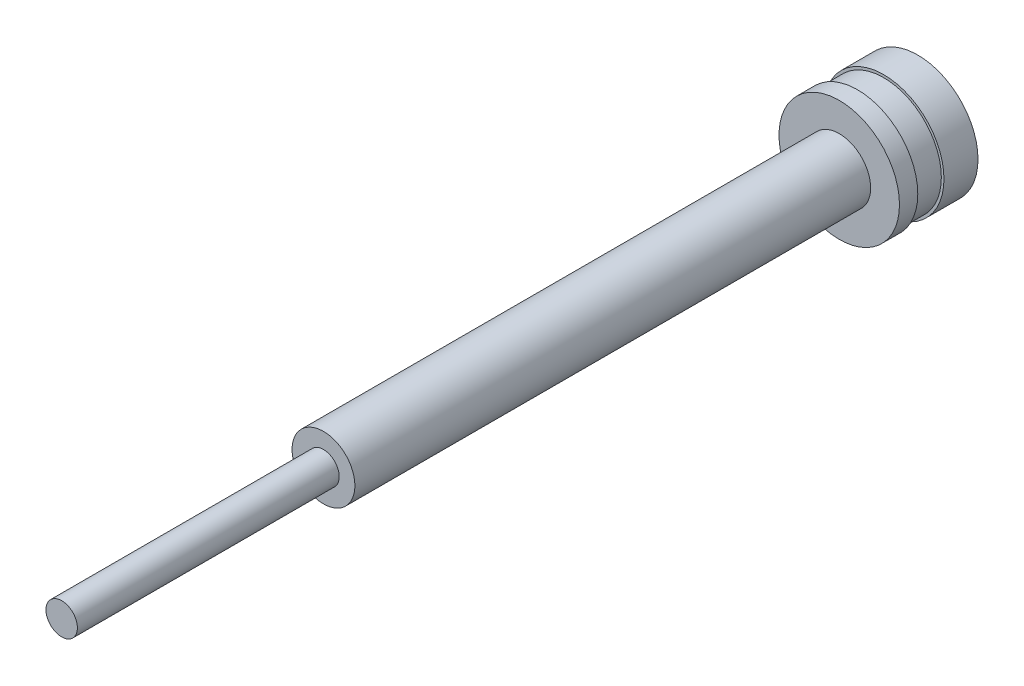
from build123d import *


with BuildPart() as part:
    # Esquisse1 → R_volution1 (revolve)
    with BuildSketch(Plane(origin=(0, 0, 0), x_dir=(0, 0, -1), z_dir=(1, 0, 0)), mode=Mode.PRIVATE) as r_volution1_sk:
        Polygon((0, 0), (0, 3), (50, 3), (50, 6), (148.5, 6), (148.5, 11.5), (152, 11.5), (152, 11), (157, 11), (157, 11.5), (163.5, 11.5), (164.5, 6.5), (164.5, 0), align=None)
    revolve(r_volution1_sk.sketch.rotate(Axis((0, 0, 41.07207473), (0, 0, -1)), 90), axis=Axis((0, 0, 41.07207473), (0, 0, -1)))


solid = part.part
